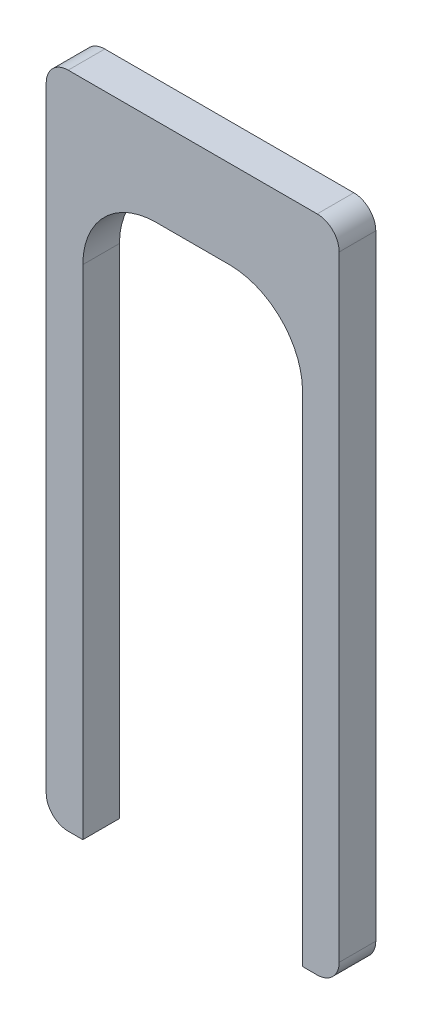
from build123d import *

# Parameters (mm, degrees)
SKETCH1_W           = 40
SKETCH1_H           = 90
BOSS_EXTRUDE1_DEPTH = 2.5
FILLET1_R           = 3
SKETCH2_W           = 30
SKETCH2_H           = 78
CUT_EXTRUDE1_DEPTH  = 50.497474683
FILLET2_R           = 10


with BuildPart() as part:
    # Sketch1 → Boss-Extrude1 (new, symmetric)
    with BuildSketch(Plane.XY):
        Rectangle(SKETCH1_W, SKETCH1_H)
    extrude(amount=BOSS_EXTRUDE1_DEPTH, both=True)

    # Fillet1
    fillet1_edges = [part.edges().sort_by_distance(p)[0] for p in [
        (-20, 45, 0),
        (20, 45, 0),
        (20, -45, 0),
        (-20, -45, 0),
    ]]
    fillet(fillet1_edges, radius=FILLET1_R)

    # Sketch2 → Cut-Extrude1 (cut, through all)
    with BuildSketch(Plane.XY.offset(2.5)):
        with Locations((0, -6)):
            Rectangle(SKETCH2_W, SKETCH2_H)
    extrude(amount=-CUT_EXTRUDE1_DEPTH, mode=Mode.SUBTRACT)

    # Fillet2
    fillet2_edges = [part.edges().sort_by_distance(p)[0] for p in [
        (-15, 33, 0),
        (15, 33, 0),
    ]]
    fillet(fillet2_edges, radius=FILLET2_R)


solid = part.part
